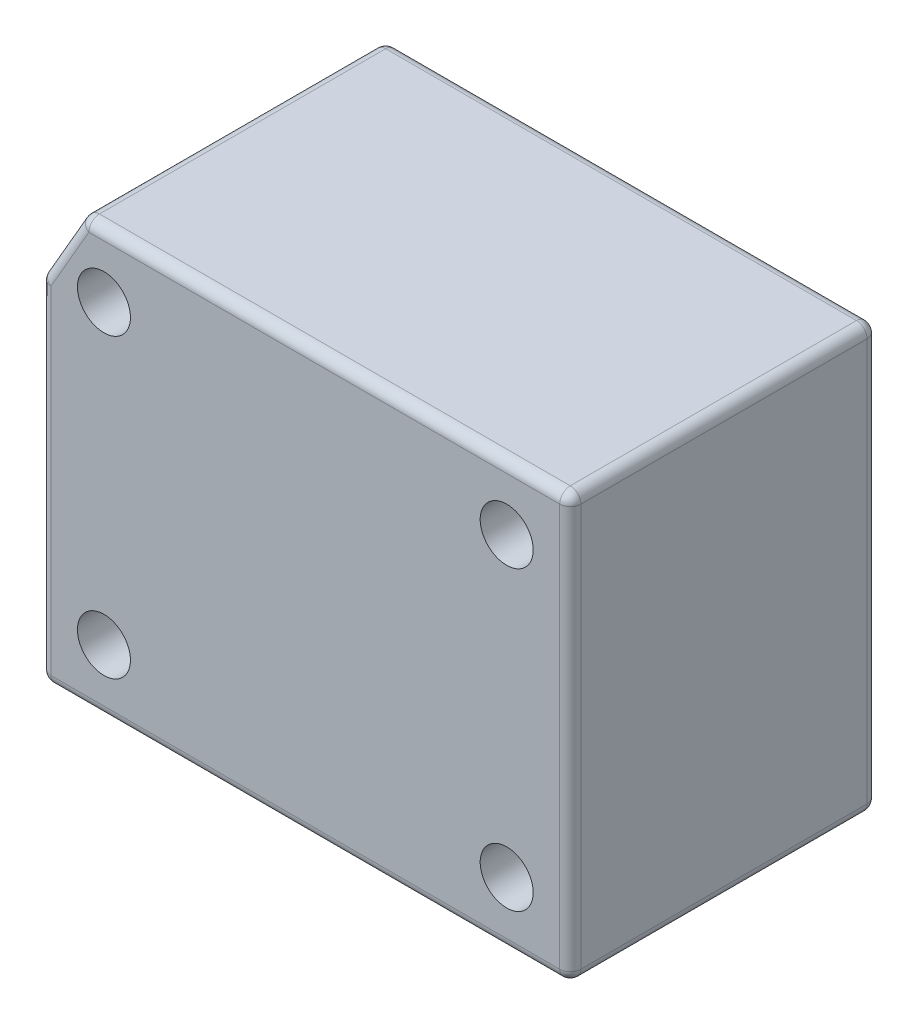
ISO-10303-21;
HEADER;
FILE_DESCRIPTION(('STEP AP214'),'2;1');
FILE_NAME('part.step','',(''),(''),'','','');
FILE_SCHEMA(('AUTOMOTIVE_DESIGN { 1 0 10303 214 1 1 1 1 }'));
ENDSEC;
DATA;
#1=APPLICATION_CONTEXT('core data for automotive mechanical design processes');
#2=APPLICATION_PROTOCOL_DEFINITION('international standard','automotive_design',2000,#1);
#3=PRODUCT_CONTEXT('',#1,'mechanical');
#4=PRODUCT('Part','Part','',(#3));
#5=PRODUCT_RELATED_PRODUCT_CATEGORY('part','',(#4));
#6=PRODUCT_DEFINITION_FORMATION('','',#4);
#7=PRODUCT_DEFINITION_CONTEXT('part definition',#1,'design');
#8=PRODUCT_DEFINITION('design','',#6,#7);
#9=PRODUCT_DEFINITION_SHAPE('','',#8);
#10=(LENGTH_UNIT() NAMED_UNIT(*) SI_UNIT(.MILLI.,.METRE.));
#11=(NAMED_UNIT(*) PLANE_ANGLE_UNIT() SI_UNIT($,.RADIAN.));
#12=(NAMED_UNIT(*) SI_UNIT($,.STERADIAN.) SOLID_ANGLE_UNIT());
#13=UNCERTAINTY_MEASURE_WITH_UNIT(LENGTH_MEASURE(1.E-05),#10,'distance_accuracy_value','');
#14=(GEOMETRIC_REPRESENTATION_CONTEXT(3) GLOBAL_UNCERTAINTY_ASSIGNED_CONTEXT((#13)) GLOBAL_UNIT_ASSIGNED_CONTEXT((#10,
#11,#12)) REPRESENTATION_CONTEXT('',''));
#15=CARTESIAN_POINT('',(0.,0.,0.));
#16=DIRECTION('',(0.,0.,1.));
#17=DIRECTION('',(1.,0.,0.));
#18=AXIS2_PLACEMENT_3D('',#15,#16,#17);
#19=CARTESIAN_POINT('',(22.,3.,0.));
#20=DIRECTION('',(0.,0.,1.));
#21=DIRECTION('',(1.,0.,0.));
#22=AXIS2_PLACEMENT_3D('',#19,#20,#21);
#23=CYLINDRICAL_SURFACE('',#22,0.750000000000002);
#24=CARTESIAN_POINT('',(22.,3.,0.));
#25=DIRECTION('',(0.,0.,1.));
#26=DIRECTION('',(1.,0.,0.));
#27=AXIS2_PLACEMENT_3D('',#24,#25,#26);
#28=CIRCLE('',#27,0.750000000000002);
#29=CARTESIAN_POINT('',(22.75,3.,0.));
#30=VERTEX_POINT('',#29);
#31=EDGE_CURVE('E270',#30,#30,#28,.T.);
#32=CARTESIAN_POINT('',(22.,3.,9.5));
#33=DIRECTION('',(0.,0.,1.));
#34=DIRECTION('',(1.,0.,0.));
#35=AXIS2_PLACEMENT_3D('',#32,#33,#34);
#36=CIRCLE('',#35,0.750000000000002);
#37=CARTESIAN_POINT('',(22.75,3.,9.5));
#38=VERTEX_POINT('',#37);
#39=EDGE_CURVE('E39',#38,#38,#36,.F.);
#40=CARTESIAN_POINT('',(22.75,3.,0.));
#41=CARTESIAN_POINT('',(22.75,3.,0.0989583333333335));
#42=CARTESIAN_POINT('',(22.75,3.,0.197916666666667));
#43=CARTESIAN_POINT('',(22.75,3.,0.395833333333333));
#44=CARTESIAN_POINT('',(22.75,3.,0.494791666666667));
#45=CARTESIAN_POINT('',(22.75,3.,0.692708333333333));
#46=CARTESIAN_POINT('',(22.75,3.,0.791666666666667));
#47=CARTESIAN_POINT('',(22.75,3.,0.989583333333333));
#48=CARTESIAN_POINT('',(22.75,3.,1.08854166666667));
#49=CARTESIAN_POINT('',(22.75,3.,1.28645833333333));
#50=CARTESIAN_POINT('',(22.75,3.,1.38541666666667));
#51=CARTESIAN_POINT('',(22.75,3.,1.58333333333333));
#52=CARTESIAN_POINT('',(22.75,3.,1.68229166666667));
#53=CARTESIAN_POINT('',(22.75,3.,1.88020833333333));
#54=CARTESIAN_POINT('',(22.75,3.,1.97916666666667));
#55=CARTESIAN_POINT('',(22.75,3.,2.17708333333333));
#56=CARTESIAN_POINT('',(22.75,3.,2.27604166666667));
#57=CARTESIAN_POINT('',(22.75,3.,2.47395833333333));
#58=CARTESIAN_POINT('',(22.75,3.,2.57291666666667));
#59=CARTESIAN_POINT('',(22.75,3.,2.77083333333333));
#60=CARTESIAN_POINT('',(22.75,3.,2.86979166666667));
#61=CARTESIAN_POINT('',(22.75,3.,3.06770833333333));
#62=CARTESIAN_POINT('',(22.75,3.,3.16666666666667));
#63=CARTESIAN_POINT('',(22.75,3.,3.36458333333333));
#64=CARTESIAN_POINT('',(22.75,3.,3.46354166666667));
#65=CARTESIAN_POINT('',(22.75,3.,3.66145833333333));
#66=CARTESIAN_POINT('',(22.75,3.,3.76041666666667));
#67=CARTESIAN_POINT('',(22.75,3.,3.95833333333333));
#68=CARTESIAN_POINT('',(22.75,3.,4.05729166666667));
#69=CARTESIAN_POINT('',(22.75,3.,4.25520833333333));
#70=CARTESIAN_POINT('',(22.75,3.,4.35416666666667));
#71=CARTESIAN_POINT('',(22.75,3.,4.55208333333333));
#72=CARTESIAN_POINT('',(22.75,3.,4.65104166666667));
#73=CARTESIAN_POINT('',(22.75,3.,4.84895833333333));
#74=CARTESIAN_POINT('',(22.75,3.,4.94791666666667));
#75=CARTESIAN_POINT('',(22.75,3.,5.14583333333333));
#76=CARTESIAN_POINT('',(22.75,3.,5.24479166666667));
#77=CARTESIAN_POINT('',(22.75,3.,5.44270833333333));
#78=CARTESIAN_POINT('',(22.75,3.,5.54166666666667));
#79=CARTESIAN_POINT('',(22.75,3.,5.73958333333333));
#80=CARTESIAN_POINT('',(22.75,3.,5.83854166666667));
#81=CARTESIAN_POINT('',(22.75,3.,6.03645833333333));
#82=CARTESIAN_POINT('',(22.75,3.,6.13541666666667));
#83=CARTESIAN_POINT('',(22.75,3.,6.33333333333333));
#84=CARTESIAN_POINT('',(22.75,3.,6.43229166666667));
#85=CARTESIAN_POINT('',(22.75,3.,6.63020833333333));
#86=CARTESIAN_POINT('',(22.75,3.,6.72916666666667));
#87=CARTESIAN_POINT('',(22.75,3.,6.92708333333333));
#88=CARTESIAN_POINT('',(22.75,3.,7.02604166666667));
#89=CARTESIAN_POINT('',(22.75,3.,7.22395833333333));
#90=CARTESIAN_POINT('',(22.75,3.,7.32291666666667));
#91=CARTESIAN_POINT('',(22.75,3.,7.52083333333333));
#92=CARTESIAN_POINT('',(22.75,3.,7.61979166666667));
#93=CARTESIAN_POINT('',(22.75,3.,7.81770833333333));
#94=CARTESIAN_POINT('',(22.75,3.,7.91666666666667));
#95=CARTESIAN_POINT('',(22.75,3.,8.11458333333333));
#96=CARTESIAN_POINT('',(22.75,3.,8.21354166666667));
#97=CARTESIAN_POINT('',(22.75,3.,8.41145833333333));
#98=CARTESIAN_POINT('',(22.75,3.,8.51041666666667));
#99=CARTESIAN_POINT('',(22.75,3.,8.70833333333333));
#100=CARTESIAN_POINT('',(22.75,3.,8.80729166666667));
#101=CARTESIAN_POINT('',(22.75,3.,9.00520833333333));
#102=CARTESIAN_POINT('',(22.75,3.,9.10416666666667));
#103=CARTESIAN_POINT('',(22.75,3.,9.30208333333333));
#104=CARTESIAN_POINT('',(22.75,3.,9.40104166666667));
#105=CARTESIAN_POINT('',(22.75,3.,9.5));
#106=B_SPLINE_CURVE_WITH_KNOTS('',3,(#40,#41,#42,#43,#44,#45,#46,#47,#48,#49,#50,#51,#52,#53,
#54,#55,#56,#57,#58,#59,#60,#61,#62,#63,#64,#65,#66,#67,#68,#69,#70,#71,#72,#73,#74,#75,#76,#77,
#78,#79,#80,#81,#82,#83,#84,#85,#86,#87,#88,#89,#90,#91,#92,#93,#94,#95,#96,#97,#98,#99,#100,
#101,#102,#103,#104,#105),.UNSPECIFIED.,.F.,.F.,(4,2,2,2,2,2,2,2,2,2,2,2,2,2,2,2,2,2,2,2,2,2,2,
2,2,2,2,2,2,2,2,2,4),(0.,0.296875,0.59375,0.890625,1.1875,1.484375,1.78125,2.078125,2.375,
2.671875,2.96875,3.265625,3.5625,3.859375,4.15625,4.453125,4.75,5.046875,5.34375,5.640625,
5.9375,6.234375,6.53125,6.828125,7.125,7.421875,7.71875,8.015625,8.3125,8.609375,8.90625,
9.203125,9.5),.UNSPECIFIED.);
#107=EDGE_CURVE('BSEAM35',#30,#38,#106,.T.);
#108=ORIENTED_EDGE('',*,*,#31,.F.);
#109=ORIENTED_EDGE('',*,*,#39,.F.);
#110=ORIENTED_EDGE('',*,*,#107,.T.);
#111=ORIENTED_EDGE('',*,*,#107,.F.);
#112=EDGE_LOOP('',(#108,#110,#109,#111));
#113=FACE_BOUND('',#112,.T.);
#114=ADVANCED_FACE('F35',(#113),#23,.F.);
#115=CARTESIAN_POINT('',(3.,3.,0.));
#116=DIRECTION('',(0.,0.,1.));
#117=DIRECTION('',(1.,0.,0.));
#118=AXIS2_PLACEMENT_3D('',#115,#116,#117);
#119=CYLINDRICAL_SURFACE('',#118,0.75);
#120=CARTESIAN_POINT('',(3.,3.,0.));
#121=DIRECTION('',(0.,0.,1.));
#122=DIRECTION('',(1.,0.,0.));
#123=AXIS2_PLACEMENT_3D('',#120,#121,#122);
#124=CIRCLE('',#123,0.75);
#125=CARTESIAN_POINT('',(3.75,3.,0.));
#126=VERTEX_POINT('',#125);
#127=EDGE_CURVE('E237',#126,#126,#124,.T.);
#128=CARTESIAN_POINT('',(3.,3.,9.5));
#129=DIRECTION('',(0.,0.,1.));
#130=DIRECTION('',(1.,0.,0.));
#131=AXIS2_PLACEMENT_3D('',#128,#129,#130);
#132=CIRCLE('',#131,0.75);
#133=CARTESIAN_POINT('',(3.75,3.,9.5));
#134=VERTEX_POINT('',#133);
#135=EDGE_CURVE('E243',#134,#134,#132,.F.);
#136=CARTESIAN_POINT('',(3.75,3.,0.));
#137=CARTESIAN_POINT('',(3.75,3.,0.0989583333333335));
#138=CARTESIAN_POINT('',(3.75,3.,0.197916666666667));
#139=CARTESIAN_POINT('',(3.75,3.,0.395833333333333));
#140=CARTESIAN_POINT('',(3.75,3.,0.494791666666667));
#141=CARTESIAN_POINT('',(3.75,3.,0.692708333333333));
#142=CARTESIAN_POINT('',(3.75,3.,0.791666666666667));
#143=CARTESIAN_POINT('',(3.75,3.,0.989583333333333));
#144=CARTESIAN_POINT('',(3.75,3.,1.08854166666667));
#145=CARTESIAN_POINT('',(3.75,3.,1.28645833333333));
#146=CARTESIAN_POINT('',(3.75,3.,1.38541666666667));
#147=CARTESIAN_POINT('',(3.75,3.,1.58333333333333));
#148=CARTESIAN_POINT('',(3.75,3.,1.68229166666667));
#149=CARTESIAN_POINT('',(3.75,3.,1.88020833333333));
#150=CARTESIAN_POINT('',(3.75,3.,1.97916666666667));
#151=CARTESIAN_POINT('',(3.75,3.,2.17708333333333));
#152=CARTESIAN_POINT('',(3.75,3.,2.27604166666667));
#153=CARTESIAN_POINT('',(3.75,3.,2.47395833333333));
#154=CARTESIAN_POINT('',(3.75,3.,2.57291666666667));
#155=CARTESIAN_POINT('',(3.75,3.,2.77083333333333));
#156=CARTESIAN_POINT('',(3.75,3.,2.86979166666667));
#157=CARTESIAN_POINT('',(3.75,3.,3.06770833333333));
#158=CARTESIAN_POINT('',(3.75,3.,3.16666666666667));
#159=CARTESIAN_POINT('',(3.75,3.,3.36458333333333));
#160=CARTESIAN_POINT('',(3.75,3.,3.46354166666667));
#161=CARTESIAN_POINT('',(3.75,3.,3.66145833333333));
#162=CARTESIAN_POINT('',(3.75,3.,3.76041666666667));
#163=CARTESIAN_POINT('',(3.75,3.,3.95833333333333));
#164=CARTESIAN_POINT('',(3.75,3.,4.05729166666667));
#165=CARTESIAN_POINT('',(3.75,3.,4.25520833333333));
#166=CARTESIAN_POINT('',(3.75,3.,4.35416666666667));
#167=CARTESIAN_POINT('',(3.75,3.,4.55208333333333));
#168=CARTESIAN_POINT('',(3.75,3.,4.65104166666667));
#169=CARTESIAN_POINT('',(3.75,3.,4.84895833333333));
#170=CARTESIAN_POINT('',(3.75,3.,4.94791666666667));
#171=CARTESIAN_POINT('',(3.75,3.,5.14583333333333));
#172=CARTESIAN_POINT('',(3.75,3.,5.24479166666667));
#173=CARTESIAN_POINT('',(3.75,3.,5.44270833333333));
#174=CARTESIAN_POINT('',(3.75,3.,5.54166666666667));
#175=CARTESIAN_POINT('',(3.75,3.,5.73958333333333));
#176=CARTESIAN_POINT('',(3.75,3.,5.83854166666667));
#177=CARTESIAN_POINT('',(3.75,3.,6.03645833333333));
#178=CARTESIAN_POINT('',(3.75,3.,6.13541666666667));
#179=CARTESIAN_POINT('',(3.75,3.,6.33333333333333));
#180=CARTESIAN_POINT('',(3.75,3.,6.43229166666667));
#181=CARTESIAN_POINT('',(3.75,3.,6.63020833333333));
#182=CARTESIAN_POINT('',(3.75,3.,6.72916666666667));
#183=CARTESIAN_POINT('',(3.75,3.,6.92708333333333));
#184=CARTESIAN_POINT('',(3.75,3.,7.02604166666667));
#185=CARTESIAN_POINT('',(3.75,3.,7.22395833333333));
#186=CARTESIAN_POINT('',(3.75,3.,7.32291666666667));
#187=CARTESIAN_POINT('',(3.75,3.,7.52083333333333));
#188=CARTESIAN_POINT('',(3.75,3.,7.61979166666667));
#189=CARTESIAN_POINT('',(3.75,3.,7.81770833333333));
#190=CARTESIAN_POINT('',(3.75,3.,7.91666666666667));
#191=CARTESIAN_POINT('',(3.75,3.,8.11458333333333));
#192=CARTESIAN_POINT('',(3.75,3.,8.21354166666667));
#193=CARTESIAN_POINT('',(3.75,3.,8.41145833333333));
#194=CARTESIAN_POINT('',(3.75,3.,8.51041666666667));
#195=CARTESIAN_POINT('',(3.75,3.,8.70833333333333));
#196=CARTESIAN_POINT('',(3.75,3.,8.80729166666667));
#197=CARTESIAN_POINT('',(3.75,3.,9.00520833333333));
#198=CARTESIAN_POINT('',(3.75,3.,9.10416666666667));
#199=CARTESIAN_POINT('',(3.75,3.,9.30208333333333));
#200=CARTESIAN_POINT('',(3.75,3.,9.40104166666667));
#201=CARTESIAN_POINT('',(3.75,3.,9.5));
#202=B_SPLINE_CURVE_WITH_KNOTS('',3,(#136,#137,#138,#139,#140,#141,#142,#143,#144,#145,#146,
#147,#148,#149,#150,#151,#152,#153,#154,#155,#156,#157,#158,#159,#160,#161,#162,#163,#164,#165,
#166,#167,#168,#169,#170,#171,#172,#173,#174,#175,#176,#177,#178,#179,#180,#181,#182,#183,#184,
#185,#186,#187,#188,#189,#190,#191,#192,#193,#194,#195,#196,#197,#198,#199,#200,#201),
.UNSPECIFIED.,.F.,.F.,(4,2,2,2,2,2,2,2,2,2,2,2,2,2,2,2,2,2,2,2,2,2,2,2,2,2,2,2,2,2,2,2,4),(0.,
0.296875,0.59375,0.890625,1.1875,1.484375,1.78125,2.078125,2.375,2.671875,2.96875,3.265625,
3.5625,3.859375,4.15625,4.453125,4.75,5.046875,5.34375,5.640625,5.9375,6.234375,6.53125,
6.828125,7.125,7.421875,7.71875,8.015625,8.3125,8.609375,8.90625,9.203125,9.5),.UNSPECIFIED.);
#203=EDGE_CURVE('BSEAM445',#126,#134,#202,.T.);
#204=ORIENTED_EDGE('',*,*,#127,.F.);
#205=ORIENTED_EDGE('',*,*,#135,.F.);
#206=ORIENTED_EDGE('',*,*,#203,.T.);
#207=ORIENTED_EDGE('',*,*,#203,.F.);
#208=EDGE_LOOP('',(#204,#206,#205,#207));
#209=FACE_BOUND('',#208,.T.);
#210=ADVANCED_FACE('F445',(#209),#119,.F.);
#211=CARTESIAN_POINT('',(22.,17.,0.));
#212=DIRECTION('',(0.,0.,1.));
#213=DIRECTION('',(1.,0.,0.));
#214=AXIS2_PLACEMENT_3D('',#211,#212,#213);
#215=CYLINDRICAL_SURFACE('',#214,0.750000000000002);
#216=CARTESIAN_POINT('',(22.,17.,0.));
#217=DIRECTION('',(0.,0.,1.));
#218=DIRECTION('',(1.,0.,0.));
#219=AXIS2_PLACEMENT_3D('',#216,#217,#218);
#220=CIRCLE('',#219,0.750000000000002);
#221=CARTESIAN_POINT('',(22.75,17.,0.));
#222=VERTEX_POINT('',#221);
#223=EDGE_CURVE('E273',#222,#222,#220,.T.);
#224=CARTESIAN_POINT('',(22.,17.,9.5));
#225=DIRECTION('',(0.,0.,1.));
#226=DIRECTION('',(1.,0.,0.));
#227=AXIS2_PLACEMENT_3D('',#224,#225,#226);
#228=CIRCLE('',#227,0.750000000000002);
#229=CARTESIAN_POINT('',(22.75,17.,9.5));
#230=VERTEX_POINT('',#229);
#231=EDGE_CURVE('E239',#230,#230,#228,.F.);
#232=CARTESIAN_POINT('',(22.75,17.,0.));
#233=CARTESIAN_POINT('',(22.75,17.,0.0989583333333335));
#234=CARTESIAN_POINT('',(22.75,17.,0.197916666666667));
#235=CARTESIAN_POINT('',(22.75,17.,0.395833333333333));
#236=CARTESIAN_POINT('',(22.75,17.,0.494791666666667));
#237=CARTESIAN_POINT('',(22.75,17.,0.692708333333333));
#238=CARTESIAN_POINT('',(22.75,17.,0.791666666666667));
#239=CARTESIAN_POINT('',(22.75,17.,0.989583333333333));
#240=CARTESIAN_POINT('',(22.75,17.,1.08854166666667));
#241=CARTESIAN_POINT('',(22.75,17.,1.28645833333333));
#242=CARTESIAN_POINT('',(22.75,17.,1.38541666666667));
#243=CARTESIAN_POINT('',(22.75,17.,1.58333333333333));
#244=CARTESIAN_POINT('',(22.75,17.,1.68229166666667));
#245=CARTESIAN_POINT('',(22.75,17.,1.88020833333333));
#246=CARTESIAN_POINT('',(22.75,17.,1.97916666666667));
#247=CARTESIAN_POINT('',(22.75,17.,2.17708333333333));
#248=CARTESIAN_POINT('',(22.75,17.,2.27604166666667));
#249=CARTESIAN_POINT('',(22.75,17.,2.47395833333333));
#250=CARTESIAN_POINT('',(22.75,17.,2.57291666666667));
#251=CARTESIAN_POINT('',(22.75,17.,2.77083333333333));
#252=CARTESIAN_POINT('',(22.75,17.,2.86979166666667));
#253=CARTESIAN_POINT('',(22.75,17.,3.06770833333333));
#254=CARTESIAN_POINT('',(22.75,17.,3.16666666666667));
#255=CARTESIAN_POINT('',(22.75,17.,3.36458333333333));
#256=CARTESIAN_POINT('',(22.75,17.,3.46354166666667));
#257=CARTESIAN_POINT('',(22.75,17.,3.66145833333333));
#258=CARTESIAN_POINT('',(22.75,17.,3.76041666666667));
#259=CARTESIAN_POINT('',(22.75,17.,3.95833333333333));
#260=CARTESIAN_POINT('',(22.75,17.,4.05729166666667));
#261=CARTESIAN_POINT('',(22.75,17.,4.25520833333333));
#262=CARTESIAN_POINT('',(22.75,17.,4.35416666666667));
#263=CARTESIAN_POINT('',(22.75,17.,4.55208333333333));
#264=CARTESIAN_POINT('',(22.75,17.,4.65104166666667));
#265=CARTESIAN_POINT('',(22.75,17.,4.84895833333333));
#266=CARTESIAN_POINT('',(22.75,17.,4.94791666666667));
#267=CARTESIAN_POINT('',(22.75,17.,5.14583333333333));
#268=CARTESIAN_POINT('',(22.75,17.,5.24479166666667));
#269=CARTESIAN_POINT('',(22.75,17.,5.44270833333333));
#270=CARTESIAN_POINT('',(22.75,17.,5.54166666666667));
#271=CARTESIAN_POINT('',(22.75,17.,5.73958333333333));
#272=CARTESIAN_POINT('',(22.75,17.,5.83854166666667));
#273=CARTESIAN_POINT('',(22.75,17.,6.03645833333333));
#274=CARTESIAN_POINT('',(22.75,17.,6.13541666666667));
#275=CARTESIAN_POINT('',(22.75,17.,6.33333333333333));
#276=CARTESIAN_POINT('',(22.75,17.,6.43229166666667));
#277=CARTESIAN_POINT('',(22.75,17.,6.63020833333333));
#278=CARTESIAN_POINT('',(22.75,17.,6.72916666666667));
#279=CARTESIAN_POINT('',(22.75,17.,6.92708333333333));
#280=CARTESIAN_POINT('',(22.75,17.,7.02604166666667));
#281=CARTESIAN_POINT('',(22.75,17.,7.22395833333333));
#282=CARTESIAN_POINT('',(22.75,17.,7.32291666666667));
#283=CARTESIAN_POINT('',(22.75,17.,7.52083333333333));
#284=CARTESIAN_POINT('',(22.75,17.,7.61979166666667));
#285=CARTESIAN_POINT('',(22.75,17.,7.81770833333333));
#286=CARTESIAN_POINT('',(22.75,17.,7.91666666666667));
#287=CARTESIAN_POINT('',(22.75,17.,8.11458333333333));
#288=CARTESIAN_POINT('',(22.75,17.,8.21354166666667));
#289=CARTESIAN_POINT('',(22.75,17.,8.41145833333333));
#290=CARTESIAN_POINT('',(22.75,17.,8.51041666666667));
#291=CARTESIAN_POINT('',(22.75,17.,8.70833333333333));
#292=CARTESIAN_POINT('',(22.75,17.,8.80729166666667));
#293=CARTESIAN_POINT('',(22.75,17.,9.00520833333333));
#294=CARTESIAN_POINT('',(22.75,17.,9.10416666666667));
#295=CARTESIAN_POINT('',(22.75,17.,9.30208333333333));
#296=CARTESIAN_POINT('',(22.75,17.,9.40104166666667));
#297=CARTESIAN_POINT('',(22.75,17.,9.5));
#298=B_SPLINE_CURVE_WITH_KNOTS('',3,(#232,#233,#234,#235,#236,#237,#238,#239,#240,#241,#242,
#243,#244,#245,#246,#247,#248,#249,#250,#251,#252,#253,#254,#255,#256,#257,#258,#259,#260,#261,
#262,#263,#264,#265,#266,#267,#268,#269,#270,#271,#272,#273,#274,#275,#276,#277,#278,#279,#280,
#281,#282,#283,#284,#285,#286,#287,#288,#289,#290,#291,#292,#293,#294,#295,#296,#297),
.UNSPECIFIED.,.F.,.F.,(4,2,2,2,2,2,2,2,2,2,2,2,2,2,2,2,2,2,2,2,2,2,2,2,2,2,2,2,2,2,2,2,4),(0.,
0.296875,0.59375,0.890625,1.1875,1.484375,1.78125,2.078125,2.375,2.671875,2.96875,3.265625,
3.5625,3.859375,4.15625,4.453125,4.75,5.046875,5.34375,5.640625,5.9375,6.234375,6.53125,
6.828125,7.125,7.421875,7.71875,8.015625,8.3125,8.609375,8.90625,9.203125,9.5),.UNSPECIFIED.);
#299=EDGE_CURVE('BSEAM451',#222,#230,#298,.T.);
#300=ORIENTED_EDGE('',*,*,#223,.F.);
#301=ORIENTED_EDGE('',*,*,#231,.F.);
#302=ORIENTED_EDGE('',*,*,#299,.T.);
#303=ORIENTED_EDGE('',*,*,#299,.F.);
#304=EDGE_LOOP('',(#300,#302,#301,#303));
#305=FACE_BOUND('',#304,.T.);
#306=ADVANCED_FACE('F451',(#305),#215,.F.);
#307=CARTESIAN_POINT('',(3.,17.,0.));
#308=DIRECTION('',(0.,0.,1.));
#309=DIRECTION('',(1.,0.,0.));
#310=AXIS2_PLACEMENT_3D('',#307,#308,#309);
#311=CYLINDRICAL_SURFACE('',#310,0.75);
#312=CARTESIAN_POINT('',(3.,17.,0.));
#313=DIRECTION('',(0.,0.,1.));
#314=DIRECTION('',(1.,0.,0.));
#315=AXIS2_PLACEMENT_3D('',#312,#313,#314);
#316=CIRCLE('',#315,0.75);
#317=CARTESIAN_POINT('',(3.75,17.,0.));
#318=VERTEX_POINT('',#317);
#319=EDGE_CURVE('E231',#318,#318,#316,.T.);
#320=CARTESIAN_POINT('',(3.,17.,9.5));
#321=DIRECTION('',(0.,0.,1.));
#322=DIRECTION('',(1.,0.,0.));
#323=AXIS2_PLACEMENT_3D('',#320,#321,#322);
#324=CIRCLE('',#323,0.75);
#325=CARTESIAN_POINT('',(3.75,17.,9.5));
#326=VERTEX_POINT('',#325);
#327=EDGE_CURVE('E234',#326,#326,#324,.F.);
#328=CARTESIAN_POINT('',(3.75,17.,0.));
#329=CARTESIAN_POINT('',(3.75,17.,0.0989583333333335));
#330=CARTESIAN_POINT('',(3.75,17.,0.197916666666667));
#331=CARTESIAN_POINT('',(3.75,17.,0.395833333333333));
#332=CARTESIAN_POINT('',(3.75,17.,0.494791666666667));
#333=CARTESIAN_POINT('',(3.75,17.,0.692708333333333));
#334=CARTESIAN_POINT('',(3.75,17.,0.791666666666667));
#335=CARTESIAN_POINT('',(3.75,17.,0.989583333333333));
#336=CARTESIAN_POINT('',(3.75,17.,1.08854166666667));
#337=CARTESIAN_POINT('',(3.75,17.,1.28645833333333));
#338=CARTESIAN_POINT('',(3.75,17.,1.38541666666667));
#339=CARTESIAN_POINT('',(3.75,17.,1.58333333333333));
#340=CARTESIAN_POINT('',(3.75,17.,1.68229166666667));
#341=CARTESIAN_POINT('',(3.75,17.,1.88020833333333));
#342=CARTESIAN_POINT('',(3.75,17.,1.97916666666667));
#343=CARTESIAN_POINT('',(3.75,17.,2.17708333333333));
#344=CARTESIAN_POINT('',(3.75,17.,2.27604166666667));
#345=CARTESIAN_POINT('',(3.75,17.,2.47395833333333));
#346=CARTESIAN_POINT('',(3.75,17.,2.57291666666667));
#347=CARTESIAN_POINT('',(3.75,17.,2.77083333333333));
#348=CARTESIAN_POINT('',(3.75,17.,2.86979166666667));
#349=CARTESIAN_POINT('',(3.75,17.,3.06770833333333));
#350=CARTESIAN_POINT('',(3.75,17.,3.16666666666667));
#351=CARTESIAN_POINT('',(3.75,17.,3.36458333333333));
#352=CARTESIAN_POINT('',(3.75,17.,3.46354166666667));
#353=CARTESIAN_POINT('',(3.75,17.,3.66145833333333));
#354=CARTESIAN_POINT('',(3.75,17.,3.76041666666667));
#355=CARTESIAN_POINT('',(3.75,17.,3.95833333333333));
#356=CARTESIAN_POINT('',(3.75,17.,4.05729166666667));
#357=CARTESIAN_POINT('',(3.75,17.,4.25520833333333));
#358=CARTESIAN_POINT('',(3.75,17.,4.35416666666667));
#359=CARTESIAN_POINT('',(3.75,17.,4.55208333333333));
#360=CARTESIAN_POINT('',(3.75,17.,4.65104166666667));
#361=CARTESIAN_POINT('',(3.75,17.,4.84895833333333));
#362=CARTESIAN_POINT('',(3.75,17.,4.94791666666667));
#363=CARTESIAN_POINT('',(3.75,17.,5.14583333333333));
#364=CARTESIAN_POINT('',(3.75,17.,5.24479166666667));
#365=CARTESIAN_POINT('',(3.75,17.,5.44270833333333));
#366=CARTESIAN_POINT('',(3.75,17.,5.54166666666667));
#367=CARTESIAN_POINT('',(3.75,17.,5.73958333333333));
#368=CARTESIAN_POINT('',(3.75,17.,5.83854166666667));
#369=CARTESIAN_POINT('',(3.75,17.,6.03645833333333));
#370=CARTESIAN_POINT('',(3.75,17.,6.13541666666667));
#371=CARTESIAN_POINT('',(3.75,17.,6.33333333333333));
#372=CARTESIAN_POINT('',(3.75,17.,6.43229166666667));
#373=CARTESIAN_POINT('',(3.75,17.,6.63020833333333));
#374=CARTESIAN_POINT('',(3.75,17.,6.72916666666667));
#375=CARTESIAN_POINT('',(3.75,17.,6.92708333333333));
#376=CARTESIAN_POINT('',(3.75,17.,7.02604166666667));
#377=CARTESIAN_POINT('',(3.75,17.,7.22395833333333));
#378=CARTESIAN_POINT('',(3.75,17.,7.32291666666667));
#379=CARTESIAN_POINT('',(3.75,17.,7.52083333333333));
#380=CARTESIAN_POINT('',(3.75,17.,7.61979166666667));
#381=CARTESIAN_POINT('',(3.75,17.,7.81770833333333));
#382=CARTESIAN_POINT('',(3.75,17.,7.91666666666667));
#383=CARTESIAN_POINT('',(3.75,17.,8.11458333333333));
#384=CARTESIAN_POINT('',(3.75,17.,8.21354166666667));
#385=CARTESIAN_POINT('',(3.75,17.,8.41145833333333));
#386=CARTESIAN_POINT('',(3.75,17.,8.51041666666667));
#387=CARTESIAN_POINT('',(3.75,17.,8.70833333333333));
#388=CARTESIAN_POINT('',(3.75,17.,8.80729166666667));
#389=CARTESIAN_POINT('',(3.75,17.,9.00520833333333));
#390=CARTESIAN_POINT('',(3.75,17.,9.10416666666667));
#391=CARTESIAN_POINT('',(3.75,17.,9.30208333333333));
#392=CARTESIAN_POINT('',(3.75,17.,9.40104166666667));
#393=CARTESIAN_POINT('',(3.75,17.,9.5));
#394=B_SPLINE_CURVE_WITH_KNOTS('',3,(#328,#329,#330,#331,#332,#333,#334,#335,#336,#337,#338,
#339,#340,#341,#342,#343,#344,#345,#346,#347,#348,#349,#350,#351,#352,#353,#354,#355,#356,#357,
#358,#359,#360,#361,#362,#363,#364,#365,#366,#367,#368,#369,#370,#371,#372,#373,#374,#375,#376,
#377,#378,#379,#380,#381,#382,#383,#384,#385,#386,#387,#388,#389,#390,#391,#392,#393),
.UNSPECIFIED.,.F.,.F.,(4,2,2,2,2,2,2,2,2,2,2,2,2,2,2,2,2,2,2,2,2,2,2,2,2,2,2,2,2,2,2,2,4),(0.,
0.296875,0.59375,0.890625,1.1875,1.484375,1.78125,2.078125,2.375,2.671875,2.96875,3.265625,
3.5625,3.859375,4.15625,4.453125,4.75,5.046875,5.34375,5.640625,5.9375,6.234375,6.53125,
6.828125,7.125,7.421875,7.71875,8.015625,8.3125,8.609375,8.90625,9.203125,9.5),.UNSPECIFIED.);
#395=EDGE_CURVE('BSEAM460',#318,#326,#394,.T.);
#396=ORIENTED_EDGE('',*,*,#319,.F.);
#397=ORIENTED_EDGE('',*,*,#327,.F.);
#398=ORIENTED_EDGE('',*,*,#395,.T.);
#399=ORIENTED_EDGE('',*,*,#395,.F.);
#400=EDGE_LOOP('',(#396,#398,#397,#399));
#401=FACE_BOUND('',#400,.T.);
#402=ADVANCED_FACE('F460',(#401),#311,.F.);
#403=CARTESIAN_POINT('',(0.,0.,14.5));
#404=DIRECTION('',(1.,0.,0.));
#405=DIRECTION('',(0.,0.,-1.));
#406=AXIS2_PLACEMENT_3D('',#403,#404,#405);
#407=PLANE('',#406);
#408=DIRECTION('',(0.,-1.,0.));
#409=VECTOR('',#408,1.);
#410=CARTESIAN_POINT('',(0.,0.,0.5));
#411=LINE('',#410,#409);
#412=CARTESIAN_POINT('',(0.,16.4019237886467,0.5));
#413=VERTEX_POINT('',#412);
#414=CARTESIAN_POINT('',(0.,0.5,0.5));
#415=VERTEX_POINT('',#414);
#416=EDGE_CURVE('E329',#413,#415,#411,.T.);
#417=ORIENTED_EDGE('',*,*,#416,.T.);
#418=DIRECTION('',(0.,0.,-1.));
#419=VECTOR('',#418,1.);
#420=CARTESIAN_POINT('',(0.,0.5,14.5));
#421=LINE('',#420,#419);
#422=CARTESIAN_POINT('',(0.,0.5,14.));
#423=VERTEX_POINT('',#422);
#424=EDGE_CURVE('E335',#415,#423,#421,.F.);
#425=ORIENTED_EDGE('',*,*,#424,.T.);
#426=DIRECTION('',(0.,-1.,0.));
#427=VECTOR('',#426,1.);
#428=CARTESIAN_POINT('',(0.,0.,14.));
#429=LINE('',#428,#427);
#430=CARTESIAN_POINT('',(0.,16.4019237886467,14.));
#431=VERTEX_POINT('',#430);
#432=EDGE_CURVE('E332',#423,#431,#429,.F.);
#433=ORIENTED_EDGE('',*,*,#432,.T.);
#434=DIRECTION('',(0.,0.,1.));
#435=VECTOR('',#434,1.);
#436=CARTESIAN_POINT('',(0.,16.4019237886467,0.));
#437=LINE('',#436,#435);
#438=EDGE_CURVE('E327',#431,#413,#437,.F.);
#439=ORIENTED_EDGE('',*,*,#438,.T.);
#440=EDGE_LOOP('',(#417,#425,#433,#439));
#441=FACE_BOUND('',#440,.T.);
#442=ADVANCED_FACE('F421',(#441),#407,.F.);
#443=CARTESIAN_POINT('',(0.,0.,14.5));
#444=DIRECTION('',(0.,1.,0.));
#445=DIRECTION('',(0.,0.,1.));
#446=AXIS2_PLACEMENT_3D('',#443,#444,#445);
#447=PLANE('',#446);
#448=DIRECTION('',(0.,0.,-1.));
#449=VECTOR('',#448,1.);
#450=CARTESIAN_POINT('',(0.5,0.,14.5));
#451=LINE('',#450,#449);
#452=CARTESIAN_POINT('',(0.5,0.,14.));
#453=VERTEX_POINT('',#452);
#454=CARTESIAN_POINT('',(0.5,0.,0.5));
#455=VERTEX_POINT('',#454);
#456=EDGE_CURVE('E324',#453,#455,#451,.T.);
#457=ORIENTED_EDGE('',*,*,#456,.T.);
#458=DIRECTION('',(1.,0.,0.));
#459=VECTOR('',#458,1.);
#460=CARTESIAN_POINT('',(24.5,0.,0.5));
#461=LINE('',#460,#459);
#462=CARTESIAN_POINT('',(24.5,0.,0.5));
#463=VERTEX_POINT('',#462);
#464=EDGE_CURVE('E219',#455,#463,#461,.T.);
#465=ORIENTED_EDGE('',*,*,#464,.T.);
#466=DIRECTION('',(0.,0.,-1.));
#467=VECTOR('',#466,1.);
#468=CARTESIAN_POINT('',(24.5,0.,14.5));
#469=LINE('',#468,#467);
#470=CARTESIAN_POINT('',(24.5,0.,14.));
#471=VERTEX_POINT('',#470);
#472=EDGE_CURVE('E309',#463,#471,#469,.F.);
#473=ORIENTED_EDGE('',*,*,#472,.T.);
#474=DIRECTION('',(1.,0.,0.));
#475=VECTOR('',#474,1.);
#476=CARTESIAN_POINT('',(0.,0.,14.));
#477=LINE('',#476,#475);
#478=EDGE_CURVE('E217',#471,#453,#477,.F.);
#479=ORIENTED_EDGE('',*,*,#478,.T.);
#480=EDGE_LOOP('',(#457,#465,#473,#479));
#481=FACE_BOUND('',#480,.T.);
#482=ADVANCED_FACE('F407',(#481),#447,.F.);
#483=CARTESIAN_POINT('',(25.,0.,14.5));
#484=DIRECTION('',(-1.,0.,0.));
#485=DIRECTION('',(0.,0.,1.));
#486=AXIS2_PLACEMENT_3D('',#483,#484,#485);
#487=PLANE('',#486);
#488=DIRECTION('',(0.,0.,-1.));
#489=VECTOR('',#488,1.);
#490=CARTESIAN_POINT('',(25.,0.5,14.5));
#491=LINE('',#490,#489);
#492=CARTESIAN_POINT('',(25.,0.5,14.));
#493=VERTEX_POINT('',#492);
#494=CARTESIAN_POINT('',(25.,0.5,0.5));
#495=VERTEX_POINT('',#494);
#496=EDGE_CURVE('E301',#493,#495,#491,.T.);
#497=ORIENTED_EDGE('',*,*,#496,.T.);
#498=DIRECTION('',(0.,1.,0.));
#499=VECTOR('',#498,1.);
#500=CARTESIAN_POINT('',(25.,19.5,0.5));
#501=LINE('',#500,#499);
#502=CARTESIAN_POINT('',(25.,19.5,0.5));
#503=VERTEX_POINT('',#502);
#504=EDGE_CURVE('E304',#495,#503,#501,.T.);
#505=ORIENTED_EDGE('',*,*,#504,.T.);
#506=DIRECTION('',(0.,0.,-1.));
#507=VECTOR('',#506,1.);
#508=CARTESIAN_POINT('',(25.,19.5,14.5));
#509=LINE('',#508,#507);
#510=CARTESIAN_POINT('',(25.,19.5,14.));
#511=VERTEX_POINT('',#510);
#512=EDGE_CURVE('E281',#503,#511,#509,.F.);
#513=ORIENTED_EDGE('',*,*,#512,.T.);
#514=DIRECTION('',(0.,1.,0.));
#515=VECTOR('',#514,1.);
#516=CARTESIAN_POINT('',(25.,0.,14.));
#517=LINE('',#516,#515);
#518=EDGE_CURVE('E298',#511,#493,#517,.F.);
#519=ORIENTED_EDGE('',*,*,#518,.T.);
#520=EDGE_LOOP('',(#497,#505,#513,#519));
#521=FACE_BOUND('',#520,.T.);
#522=ADVANCED_FACE('F389',(#521),#487,.F.);
#523=CARTESIAN_POINT('',(0.,20.,14.5));
#524=DIRECTION('',(0.,-1.,0.));
#525=DIRECTION('',(0.,0.,-1.));
#526=AXIS2_PLACEMENT_3D('',#523,#524,#525);
#527=PLANE('',#526);
#528=DIRECTION('',(-1.,0.,0.));
#529=VECTOR('',#528,1.);
#530=CARTESIAN_POINT('',(0.,20.,14.));
#531=LINE('',#530,#529);
#532=CARTESIAN_POINT('',(2.28867513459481,20.,14.));
#533=VERTEX_POINT('',#532);
#534=CARTESIAN_POINT('',(24.5,20.,14.));
#535=VERTEX_POINT('',#534);
#536=EDGE_CURVE('E162',#533,#535,#531,.F.);
#537=ORIENTED_EDGE('',*,*,#536,.T.);
#538=DIRECTION('',(0.,0.,-1.));
#539=VECTOR('',#538,1.);
#540=CARTESIAN_POINT('',(24.5,20.,14.5));
#541=LINE('',#540,#539);
#542=CARTESIAN_POINT('',(24.5,20.,0.5));
#543=VERTEX_POINT('',#542);
#544=EDGE_CURVE('E279',#535,#543,#541,.T.);
#545=ORIENTED_EDGE('',*,*,#544,.T.);
#546=DIRECTION('',(-1.,0.,0.));
#547=VECTOR('',#546,1.);
#548=CARTESIAN_POINT('',(2.,20.,0.5));
#549=LINE('',#548,#547);
#550=CARTESIAN_POINT('',(2.28867513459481,20.,0.5));
#551=VERTEX_POINT('',#550);
#552=EDGE_CURVE('E165',#543,#551,#549,.T.);
#553=ORIENTED_EDGE('',*,*,#552,.T.);
#554=DIRECTION('',(0.,0.,-1.));
#555=VECTOR('',#554,1.);
#556=CARTESIAN_POINT('',(2.28867513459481,20.,14.5));
#557=LINE('',#556,#555);
#558=EDGE_CURVE('E148',#551,#533,#557,.F.);
#559=ORIENTED_EDGE('',*,*,#558,.T.);
#560=EDGE_LOOP('',(#537,#545,#553,#559));
#561=FACE_BOUND('',#560,.T.);
#562=ADVANCED_FACE('F160',(#561),#527,.F.);
#563=CARTESIAN_POINT('',(0.,0.,14.5));
#564=DIRECTION('',(0.,0.,-1.));
#565=DIRECTION('',(-1.,0.,0.));
#566=AXIS2_PLACEMENT_3D('',#563,#564,#565);
#567=PLANE('',#566);
#568=CARTESIAN_POINT('',(22.,3.,14.5));
#569=DIRECTION('',(0.,0.,1.));
#570=DIRECTION('',(1.,0.,0.));
#571=AXIS2_PLACEMENT_3D('',#568,#569,#570);
#572=CIRCLE('',#571,1.25);
#573=CARTESIAN_POINT('',(23.25,3.,14.5));
#574=VERTEX_POINT('',#573);
#575=EDGE_CURVE('E259',#574,#574,#572,.T.);
#576=ORIENTED_EDGE('',*,*,#575,.F.);
#577=EDGE_LOOP('',(#576));
#578=FACE_BOUND('',#577,.T.);
#579=CARTESIAN_POINT('',(3.,3.,14.5));
#580=DIRECTION('',(0.,0.,1.));
#581=DIRECTION('',(1.,0.,0.));
#582=AXIS2_PLACEMENT_3D('',#579,#580,#581);
#583=CIRCLE('',#582,1.25);
#584=CARTESIAN_POINT('',(4.25,3.,14.5));
#585=VERTEX_POINT('',#584);
#586=EDGE_CURVE('E252',#585,#585,#583,.T.);
#587=ORIENTED_EDGE('',*,*,#586,.F.);
#588=EDGE_LOOP('',(#587));
#589=FACE_BOUND('',#588,.T.);
#590=CARTESIAN_POINT('',(22.,17.,14.5));
#591=DIRECTION('',(0.,0.,1.));
#592=DIRECTION('',(1.,0.,0.));
#593=AXIS2_PLACEMENT_3D('',#590,#591,#592);
#594=CIRCLE('',#593,1.25);
#595=CARTESIAN_POINT('',(23.25,17.,14.5));
#596=VERTEX_POINT('',#595);
#597=EDGE_CURVE('E245',#596,#596,#594,.T.);
#598=ORIENTED_EDGE('',*,*,#597,.F.);
#599=EDGE_LOOP('',(#598));
#600=FACE_BOUND('',#599,.T.);
#601=CARTESIAN_POINT('',(3.,17.,14.5));
#602=DIRECTION('',(0.,0.,1.));
#603=DIRECTION('',(1.,0.,0.));
#604=AXIS2_PLACEMENT_3D('',#601,#602,#603);
#605=CIRCLE('',#604,1.25);
#606=CARTESIAN_POINT('',(4.25,17.,14.5));
#607=VERTEX_POINT('',#606);
#608=EDGE_CURVE('E241',#607,#607,#605,.T.);
#609=ORIENTED_EDGE('',*,*,#608,.F.);
#610=EDGE_LOOP('',(#609));
#611=FACE_BOUND('',#610,.T.);
#612=DIRECTION('',(0.,-1.,0.));
#613=VECTOR('',#612,1.);
#614=CARTESIAN_POINT('',(0.5,0.,14.5));
#615=LINE('',#614,#613);
#616=CARTESIAN_POINT('',(0.5,16.4019237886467,14.5));
#617=VERTEX_POINT('',#616);
#618=CARTESIAN_POINT('',(0.5,0.5,14.5));
#619=VERTEX_POINT('',#618);
#620=EDGE_CURVE('E338',#617,#619,#615,.T.);
#621=ORIENTED_EDGE('',*,*,#620,.T.);
#622=DIRECTION('',(1.,0.,0.));
#623=VECTOR('',#622,1.);
#624=CARTESIAN_POINT('',(0.,0.5,14.5));
#625=LINE('',#624,#623);
#626=CARTESIAN_POINT('',(24.5,0.5,14.5));
#627=VERTEX_POINT('',#626);
#628=EDGE_CURVE('E11',#619,#627,#625,.T.);
#629=ORIENTED_EDGE('',*,*,#628,.T.);
#630=DIRECTION('',(0.,1.,0.));
#631=VECTOR('',#630,1.);
#632=CARTESIAN_POINT('',(24.5,0.,14.5));
#633=LINE('',#632,#631);
#634=CARTESIAN_POINT('',(24.5,19.5,14.5));
#635=VERTEX_POINT('',#634);
#636=EDGE_CURVE('E312',#627,#635,#633,.T.);
#637=ORIENTED_EDGE('',*,*,#636,.T.);
#638=DIRECTION('',(-1.,0.,0.));
#639=VECTOR('',#638,1.);
#640=CARTESIAN_POINT('',(0.,19.5,14.5));
#641=LINE('',#640,#639);
#642=CARTESIAN_POINT('',(2.28867513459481,19.5,14.5));
#643=VERTEX_POINT('',#642);
#644=EDGE_CURVE('E287',#635,#643,#641,.T.);
#645=ORIENTED_EDGE('',*,*,#644,.T.);
#646=DIRECTION('',(0.500000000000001,0.866025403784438,0.));
#647=VECTOR('',#646,1.);
#648=CARTESIAN_POINT('',(0.933012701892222,17.1519237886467,14.5));
#649=LINE('',#648,#647);
#650=EDGE_CURVE('E190',#643,#617,#649,.F.);
#651=ORIENTED_EDGE('',*,*,#650,.T.);
#652=EDGE_LOOP('',(#621,#629,#637,#645,#651));
#653=FACE_BOUND('',#652,.T.);
#654=ADVANCED_FACE('F465',(#578,#589,#600,#611,#653),#567,.F.);
#655=CARTESIAN_POINT('',(0.,0.,0.));
#656=DIRECTION('',(0.,0.,-1.));
#657=DIRECTION('',(-1.,0.,0.));
#658=AXIS2_PLACEMENT_3D('',#655,#656,#657);
#659=PLANE('',#658);
#660=ORIENTED_EDGE('',*,*,#127,.T.);
#661=EDGE_LOOP('',(#660));
#662=FACE_BOUND('',#661,.T.);
#663=ORIENTED_EDGE('',*,*,#31,.T.);
#664=EDGE_LOOP('',(#663));
#665=FACE_BOUND('',#664,.T.);
#666=ORIENTED_EDGE('',*,*,#223,.T.);
#667=EDGE_LOOP('',(#666));
#668=FACE_BOUND('',#667,.T.);
#669=ORIENTED_EDGE('',*,*,#319,.T.);
#670=EDGE_LOOP('',(#669));
#671=FACE_BOUND('',#670,.T.);
#672=DIRECTION('',(0.,1.,0.));
#673=VECTOR('',#672,1.);
#674=CARTESIAN_POINT('',(24.5,0.,0.));
#675=LINE('',#674,#673);
#676=CARTESIAN_POINT('',(24.5,19.5,0.));
#677=VERTEX_POINT('',#676);
#678=CARTESIAN_POINT('',(24.5,0.5,0.));
#679=VERTEX_POINT('',#678);
#680=EDGE_CURVE('E306',#677,#679,#675,.F.);
#681=ORIENTED_EDGE('',*,*,#680,.T.);
#682=DIRECTION('',(1.,0.,0.));
#683=VECTOR('',#682,1.);
#684=CARTESIAN_POINT('',(0.5,0.5,0.));
#685=LINE('',#684,#683);
#686=CARTESIAN_POINT('',(0.5,0.5,0.));
#687=VERTEX_POINT('',#686);
#688=EDGE_CURVE('E44',#679,#687,#685,.F.);
#689=ORIENTED_EDGE('',*,*,#688,.T.);
#690=DIRECTION('',(0.,-1.,0.));
#691=VECTOR('',#690,1.);
#692=CARTESIAN_POINT('',(0.5,16.5358983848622,0.));
#693=LINE('',#692,#691);
#694=CARTESIAN_POINT('',(0.5,16.4019237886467,0.));
#695=VERTEX_POINT('',#694);
#696=EDGE_CURVE('E179',#687,#695,#693,.F.);
#697=ORIENTED_EDGE('',*,*,#696,.T.);
#698=DIRECTION('',(-0.500000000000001,-0.866025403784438,0.));
#699=VECTOR('',#698,1.);
#700=CARTESIAN_POINT('',(-6.72724133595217,3.88397459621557,0.));
#701=LINE('',#700,#699);
#702=CARTESIAN_POINT('',(2.28867513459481,19.5,0.));
#703=VERTEX_POINT('',#702);
#704=EDGE_CURVE('E181',#695,#703,#701,.F.);
#705=ORIENTED_EDGE('',*,*,#704,.T.);
#706=DIRECTION('',(-1.,0.,0.));
#707=VECTOR('',#706,1.);
#708=CARTESIAN_POINT('',(25.,19.5,0.));
#709=LINE('',#708,#707);
#710=EDGE_CURVE('E285',#703,#677,#709,.F.);
#711=ORIENTED_EDGE('',*,*,#710,.T.);
#712=EDGE_LOOP('',(#681,#689,#697,#705,#711));
#713=FACE_BOUND('',#712,.T.);
#714=ADVANCED_FACE('F369',(#662,#665,#668,#671,#713),#659,.T.);
#715=CARTESIAN_POINT('',(0.,16.5358983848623,14.5));
#716=DIRECTION('',(0.866025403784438,-0.5,0.));
#717=DIRECTION('',(0.,0.,-1.));
#718=AXIS2_PLACEMENT_3D('',#715,#716,#717);
#719=PLANE('',#718);
#720=DIRECTION('',(0.,0.,-1.));
#721=VECTOR('',#720,1.);
#722=CARTESIAN_POINT('',(0.0669872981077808,16.6519237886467,14.5));
#723=LINE('',#722,#721);
#724=CARTESIAN_POINT('',(0.0669872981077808,16.6519237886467,0.5));
#725=VERTEX_POINT('',#724);
#726=CARTESIAN_POINT('',(0.0669872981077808,16.6519237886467,14.));
#727=VERTEX_POINT('',#726);
#728=EDGE_CURVE('E342',#725,#727,#723,.F.);
#729=ORIENTED_EDGE('',*,*,#728,.T.);
#730=DIRECTION('',(-0.500000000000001,-0.866025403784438,0.));
#731=VECTOR('',#730,1.);
#732=CARTESIAN_POINT('',(1.71132486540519,19.5,14.));
#733=LINE('',#732,#731);
#734=CARTESIAN_POINT('',(1.85566243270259,19.75,14.));
#735=VERTEX_POINT('',#734);
#736=EDGE_CURVE('E192',#727,#735,#733,.F.);
#737=ORIENTED_EDGE('',*,*,#736,.T.);
#738=DIRECTION('',(0.,0.,1.));
#739=VECTOR('',#738,1.);
#740=CARTESIAN_POINT('',(1.85566243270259,19.75,0.));
#741=LINE('',#740,#739);
#742=CARTESIAN_POINT('',(1.85566243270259,19.75,0.5));
#743=VERTEX_POINT('',#742);
#744=EDGE_CURVE('E149',#735,#743,#741,.F.);
#745=ORIENTED_EDGE('',*,*,#744,.T.);
#746=DIRECTION('',(0.500000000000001,0.866025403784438,0.));
#747=VECTOR('',#746,1.);
#748=CARTESIAN_POINT('',(0.,16.5358983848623,0.5));
#749=LINE('',#748,#747);
#750=EDGE_CURVE('E340',#743,#725,#749,.F.);
#751=ORIENTED_EDGE('',*,*,#750,.T.);
#752=EDGE_LOOP('',(#729,#737,#745,#751));
#753=FACE_BOUND('',#752,.T.);
#754=ADVANCED_FACE('F432',(#753),#719,.F.);
#755=CARTESIAN_POINT('',(2.28867513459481,19.5,14.5));
#756=DIRECTION('',(0.,0.,1.));
#757=DIRECTION('',(1.,0.,0.));
#758=AXIS2_PLACEMENT_3D('',#755,#756,#757);
#759=CYLINDRICAL_SURFACE('',#758,0.5);
#760=ORIENTED_EDGE('',*,*,#744,.F.);
#761=CARTESIAN_POINT('',(2.28867513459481,19.5,14.));
#762=DIRECTION('',(0.,0.,1.));
#763=DIRECTION('',(1.,0.,0.));
#764=AXIS2_PLACEMENT_3D('',#761,#762,#763);
#765=CIRCLE('',#764,0.5);
#766=EDGE_CURVE('E144',#735,#533,#765,.F.);
#767=ORIENTED_EDGE('',*,*,#766,.T.);
#768=ORIENTED_EDGE('',*,*,#558,.F.);
#769=CARTESIAN_POINT('',(2.28867513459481,19.5,0.5));
#770=DIRECTION('',(0.,0.,1.));
#771=DIRECTION('',(1.,0.,0.));
#772=AXIS2_PLACEMENT_3D('',#769,#770,#771);
#773=CIRCLE('',#772,0.5);
#774=EDGE_CURVE('E322',#551,#743,#773,.T.);
#775=ORIENTED_EDGE('',*,*,#774,.T.);
#776=EDGE_LOOP('',(#760,#767,#768,#775));
#777=FACE_BOUND('',#776,.T.);
#778=ADVANCED_FACE('F146',(#777),#759,.T.);
#779=CARTESIAN_POINT('',(0.,19.5,14.));
#780=DIRECTION('',(-1.,0.,0.));
#781=DIRECTION('',(0.,0.,1.));
#782=AXIS2_PLACEMENT_3D('',#779,#780,#781);
#783=CYLINDRICAL_SURFACE('',#782,0.5);
#784=ORIENTED_EDGE('',*,*,#536,.F.);
#785=CARTESIAN_POINT('',(2.28867513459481,19.5,14.));
#786=DIRECTION('',(-1.,0.,0.));
#787=DIRECTION('',(0.,0.,1.));
#788=AXIS2_PLACEMENT_3D('',#785,#786,#787);
#789=CIRCLE('',#788,0.5);
#790=EDGE_CURVE('E154',#533,#643,#789,.F.);
#791=ORIENTED_EDGE('',*,*,#790,.T.);
#792=ORIENTED_EDGE('',*,*,#644,.F.);
#793=CARTESIAN_POINT('',(24.5,19.5,14.));
#794=DIRECTION('',(-1.,0.,0.));
#795=DIRECTION('',(0.,0.,1.));
#796=AXIS2_PLACEMENT_3D('',#793,#794,#795);
#797=CIRCLE('',#796,0.5);
#798=EDGE_CURVE('E173',#635,#535,#797,.T.);
#799=ORIENTED_EDGE('',*,*,#798,.T.);
#800=EDGE_LOOP('',(#784,#791,#792,#799));
#801=FACE_BOUND('',#800,.T.);
#802=ADVANCED_FACE('F169',(#801),#783,.T.);
#803=CARTESIAN_POINT('',(0.,19.5,0.5));
#804=DIRECTION('',(1.,0.,0.));
#805=DIRECTION('',(0.,0.,-1.));
#806=AXIS2_PLACEMENT_3D('',#803,#804,#805);
#807=CYLINDRICAL_SURFACE('',#806,0.5);
#808=ORIENTED_EDGE('',*,*,#710,.F.);
#809=CARTESIAN_POINT('',(2.28867513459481,19.5,0.5));
#810=DIRECTION('',(1.,0.,0.));
#811=DIRECTION('',(0.,0.,-1.));
#812=AXIS2_PLACEMENT_3D('',#809,#810,#811);
#813=CIRCLE('',#812,0.5);
#814=EDGE_CURVE('E314',#703,#551,#813,.T.);
#815=ORIENTED_EDGE('',*,*,#814,.T.);
#816=ORIENTED_EDGE('',*,*,#552,.F.);
#817=CARTESIAN_POINT('',(24.5,19.5,0.5));
#818=DIRECTION('',(1.,0.,0.));
#819=DIRECTION('',(0.,0.,-1.));
#820=AXIS2_PLACEMENT_3D('',#817,#818,#819);
#821=CIRCLE('',#820,0.5);
#822=EDGE_CURVE('E294',#543,#677,#821,.F.);
#823=ORIENTED_EDGE('',*,*,#822,.T.);
#824=EDGE_LOOP('',(#808,#815,#816,#823));
#825=FACE_BOUND('',#824,.T.);
#826=ADVANCED_FACE('F372',(#825),#807,.T.);
#827=CARTESIAN_POINT('',(24.5,19.5,14.5));
#828=DIRECTION('',(0.,0.,-1.));
#829=DIRECTION('',(-1.,0.,0.));
#830=AXIS2_PLACEMENT_3D('',#827,#828,#829);
#831=CYLINDRICAL_SURFACE('',#830,0.5);
#832=ORIENTED_EDGE('',*,*,#512,.F.);
#833=CARTESIAN_POINT('',(24.5,19.5,0.5));
#834=DIRECTION('',(0.,0.,-1.));
#835=DIRECTION('',(-1.,0.,0.));
#836=AXIS2_PLACEMENT_3D('',#833,#834,#835);
#837=CIRCLE('',#836,0.5);
#838=EDGE_CURVE('E291',#503,#543,#837,.F.);
#839=ORIENTED_EDGE('',*,*,#838,.T.);
#840=ORIENTED_EDGE('',*,*,#544,.F.);
#841=CARTESIAN_POINT('',(24.5,19.5,14.));
#842=DIRECTION('',(0.,0.,-1.));
#843=DIRECTION('',(-1.,0.,0.));
#844=AXIS2_PLACEMENT_3D('',#841,#842,#843);
#845=CIRCLE('',#844,0.5);
#846=EDGE_CURVE('E289',#535,#511,#845,.T.);
#847=ORIENTED_EDGE('',*,*,#846,.T.);
#848=EDGE_LOOP('',(#832,#839,#840,#847));
#849=FACE_BOUND('',#848,.T.);
#850=ADVANCED_FACE('F385',(#849),#831,.T.);
#851=CARTESIAN_POINT('',(24.5,19.5,14.));
#852=DIRECTION('',(0.,0.,1.));
#853=DIRECTION('',(1.,0.,0.));
#854=AXIS2_PLACEMENT_3D('',#851,#852,#853);
#855=SPHERICAL_SURFACE('',#854,0.5);
#856=ORIENTED_EDGE('',*,*,#846,.F.);
#857=ORIENTED_EDGE('',*,*,#798,.F.);
#858=CARTESIAN_POINT('',(24.5,19.5,14.));
#859=DIRECTION('',(0.,-1.,0.));
#860=DIRECTION('',(0.,0.,-1.));
#861=AXIS2_PLACEMENT_3D('',#858,#859,#860);
#862=CIRCLE('',#861,0.5);
#863=EDGE_CURVE('E174',#511,#635,#862,.T.);
#864=ORIENTED_EDGE('',*,*,#863,.F.);
#865=EDGE_LOOP('',(#856,#857,#864));
#866=FACE_BOUND('',#865,.T.);
#867=ADVANCED_FACE('F393',(#866),#855,.T.);
#868=CARTESIAN_POINT('',(24.5,0.,14.));
#869=DIRECTION('',(0.,1.,0.));
#870=DIRECTION('',(0.,0.,1.));
#871=AXIS2_PLACEMENT_3D('',#868,#869,#870);
#872=CYLINDRICAL_SURFACE('',#871,0.5);
#873=ORIENTED_EDGE('',*,*,#636,.F.);
#874=CARTESIAN_POINT('',(24.5,0.5,14.));
#875=DIRECTION('',(0.,1.,0.));
#876=DIRECTION('',(0.,0.,1.));
#877=AXIS2_PLACEMENT_3D('',#874,#875,#876);
#878=CIRCLE('',#877,0.5);
#879=EDGE_CURVE('E215',#627,#493,#878,.T.);
#880=ORIENTED_EDGE('',*,*,#879,.T.);
#881=ORIENTED_EDGE('',*,*,#518,.F.);
#882=ORIENTED_EDGE('',*,*,#863,.T.);
#883=EDGE_LOOP('',(#873,#880,#881,#882));
#884=FACE_BOUND('',#883,.T.);
#885=ADVANCED_FACE('F395',(#884),#872,.T.);
#886=CARTESIAN_POINT('',(24.5,0.5,14.5));
#887=DIRECTION('',(0.,0.,-1.));
#888=DIRECTION('',(-1.,0.,0.));
#889=AXIS2_PLACEMENT_3D('',#886,#887,#888);
#890=CYLINDRICAL_SURFACE('',#889,0.5);
#891=ORIENTED_EDGE('',*,*,#472,.F.);
#892=CARTESIAN_POINT('',(24.5,0.5,0.5));
#893=DIRECTION('',(0.,0.,-1.));
#894=DIRECTION('',(-1.,0.,0.));
#895=AXIS2_PLACEMENT_3D('',#892,#893,#894);
#896=CIRCLE('',#895,0.5);
#897=EDGE_CURVE('E212',#463,#495,#896,.F.);
#898=ORIENTED_EDGE('',*,*,#897,.T.);
#899=ORIENTED_EDGE('',*,*,#496,.F.);
#900=CARTESIAN_POINT('',(24.5,0.5,14.));
#901=DIRECTION('',(0.,0.,-1.));
#902=DIRECTION('',(-1.,0.,0.));
#903=AXIS2_PLACEMENT_3D('',#900,#901,#902);
#904=CIRCLE('',#903,0.5);
#905=EDGE_CURVE('E210',#493,#471,#904,.T.);
#906=ORIENTED_EDGE('',*,*,#905,.T.);
#907=EDGE_LOOP('',(#891,#898,#899,#906));
#908=FACE_BOUND('',#907,.T.);
#909=ADVANCED_FACE('F495',(#908),#890,.T.);
#910=CARTESIAN_POINT('',(24.5,0.,0.5));
#911=DIRECTION('',(0.,-1.,0.));
#912=DIRECTION('',(0.,0.,-1.));
#913=AXIS2_PLACEMENT_3D('',#910,#911,#912);
#914=CYLINDRICAL_SURFACE('',#913,0.5);
#915=ORIENTED_EDGE('',*,*,#504,.F.);
#916=CARTESIAN_POINT('',(24.5,0.5,0.5));
#917=DIRECTION('',(0.,-1.,0.));
#918=DIRECTION('',(0.,0.,-1.));
#919=AXIS2_PLACEMENT_3D('',#916,#917,#918);
#920=CIRCLE('',#919,0.5);
#921=EDGE_CURVE('E208',#495,#679,#920,.F.);
#922=ORIENTED_EDGE('',*,*,#921,.T.);
#923=ORIENTED_EDGE('',*,*,#680,.F.);
#924=CARTESIAN_POINT('',(24.5,19.5,0.5));
#925=DIRECTION('',(0.,1.,0.));
#926=DIRECTION('',(0.,0.,1.));
#927=AXIS2_PLACEMENT_3D('',#924,#925,#926);
#928=CIRCLE('',#927,0.5);
#929=EDGE_CURVE('E315',#503,#677,#928,.T.);
#930=ORIENTED_EDGE('',*,*,#929,.F.);
#931=EDGE_LOOP('',(#915,#922,#923,#930));
#932=FACE_BOUND('',#931,.T.);
#933=ADVANCED_FACE('F379',(#932),#914,.T.);
#934=CARTESIAN_POINT('',(24.5,19.5,0.5));
#935=DIRECTION('',(0.,0.,1.));
#936=DIRECTION('',(1.,0.,0.));
#937=AXIS2_PLACEMENT_3D('',#934,#935,#936);
#938=SPHERICAL_SURFACE('',#937,0.5);
#939=ORIENTED_EDGE('',*,*,#929,.T.);
#940=ORIENTED_EDGE('',*,*,#822,.F.);
#941=ORIENTED_EDGE('',*,*,#838,.F.);
#942=EDGE_LOOP('',(#939,#940,#941));
#943=FACE_BOUND('',#942,.T.);
#944=ADVANCED_FACE('F382',(#943),#938,.T.);
#945=CARTESIAN_POINT('',(0.5,0.,14.));
#946=DIRECTION('',(0.,-1.,0.));
#947=DIRECTION('',(0.,0.,-1.));
#948=AXIS2_PLACEMENT_3D('',#945,#946,#947);
#949=CYLINDRICAL_SURFACE('',#948,0.5);
#950=ORIENTED_EDGE('',*,*,#432,.F.);
#951=CARTESIAN_POINT('',(0.5,0.5,14.));
#952=DIRECTION('',(0.,-1.,0.));
#953=DIRECTION('',(0.,0.,-1.));
#954=AXIS2_PLACEMENT_3D('',#951,#952,#953);
#955=CIRCLE('',#954,0.5);
#956=EDGE_CURVE('E58',#423,#619,#955,.F.);
#957=ORIENTED_EDGE('',*,*,#956,.T.);
#958=ORIENTED_EDGE('',*,*,#620,.F.);
#959=CARTESIAN_POINT('',(0.5,16.4019237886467,14.));
#960=DIRECTION('',(0.,-1.,0.));
#961=DIRECTION('',(0.,0.,-1.));
#962=AXIS2_PLACEMENT_3D('',#959,#960,#961);
#963=CIRCLE('',#962,0.5);
#964=EDGE_CURVE('E188',#617,#431,#963,.T.);
#965=ORIENTED_EDGE('',*,*,#964,.T.);
#966=EDGE_LOOP('',(#950,#957,#958,#965));
#967=FACE_BOUND('',#966,.T.);
#968=ADVANCED_FACE('F492',(#967),#949,.T.);
#969=CARTESIAN_POINT('',(0.5,0.5,14.5));
#970=DIRECTION('',(0.,0.,-1.));
#971=DIRECTION('',(-1.,0.,0.));
#972=AXIS2_PLACEMENT_3D('',#969,#970,#971);
#973=CYLINDRICAL_SURFACE('',#972,0.5);
#974=ORIENTED_EDGE('',*,*,#424,.F.);
#975=CARTESIAN_POINT('',(0.5,0.5,0.5));
#976=DIRECTION('',(0.,0.,-1.));
#977=DIRECTION('',(-1.,0.,0.));
#978=AXIS2_PLACEMENT_3D('',#975,#976,#977);
#979=CIRCLE('',#978,0.5);
#980=EDGE_CURVE('E206',#415,#455,#979,.F.);
#981=ORIENTED_EDGE('',*,*,#980,.T.);
#982=ORIENTED_EDGE('',*,*,#456,.F.);
#983=CARTESIAN_POINT('',(0.5,0.5,14.));
#984=DIRECTION('',(0.,0.,-1.));
#985=DIRECTION('',(-1.,0.,0.));
#986=AXIS2_PLACEMENT_3D('',#983,#984,#985);
#987=CIRCLE('',#986,0.5);
#988=EDGE_CURVE('E203',#453,#423,#987,.T.);
#989=ORIENTED_EDGE('',*,*,#988,.T.);
#990=EDGE_LOOP('',(#974,#981,#982,#989));
#991=FACE_BOUND('',#990,.T.);
#992=ADVANCED_FACE('F412',(#991),#973,.T.);
#993=CARTESIAN_POINT('',(0.5,16.4019237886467,14.5));
#994=DIRECTION('',(0.,0.,-1.));
#995=DIRECTION('',(-1.,0.,0.));
#996=AXIS2_PLACEMENT_3D('',#993,#994,#995);
#997=CYLINDRICAL_SURFACE('',#996,0.5);
#998=ORIENTED_EDGE('',*,*,#438,.F.);
#999=CARTESIAN_POINT('',(0.5,16.4019237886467,14.));
#1000=DIRECTION('',(0.,0.,-1.));
#1001=DIRECTION('',(-1.,0.,0.));
#1002=AXIS2_PLACEMENT_3D('',#999,#1000,#1001);
#1003=CIRCLE('',#1002,0.5);
#1004=EDGE_CURVE('E153',#431,#727,#1003,.T.);
#1005=ORIENTED_EDGE('',*,*,#1004,.T.);
#1006=ORIENTED_EDGE('',*,*,#728,.F.);
#1007=CARTESIAN_POINT('',(0.5,16.4019237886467,0.5));
#1008=DIRECTION('',(0.,0.,-1.));
#1009=DIRECTION('',(0.,1.,0.));
#1010=AXIS2_PLACEMENT_3D('',#1007,#1008,#1009);
#1011=CIRCLE('',#1010,0.5);
#1012=EDGE_CURVE('E184',#413,#725,#1011,.T.);
#1013=ORIENTED_EDGE('',*,*,#1012,.F.);
#1014=EDGE_LOOP('',(#998,#1005,#1006,#1013));
#1015=FACE_BOUND('',#1014,.T.);
#1016=ADVANCED_FACE('F423',(#1015),#997,.T.);
#1017=CARTESIAN_POINT('',(0.5,0.,0.5));
#1018=DIRECTION('',(0.,1.,0.));
#1019=DIRECTION('',(0.,0.,1.));
#1020=AXIS2_PLACEMENT_3D('',#1017,#1018,#1019);
#1021=CYLINDRICAL_SURFACE('',#1020,0.5);
#1022=ORIENTED_EDGE('',*,*,#696,.F.);
#1023=CARTESIAN_POINT('',(0.5,0.5,0.5));
#1024=DIRECTION('',(0.,1.,0.));
#1025=DIRECTION('',(0.,0.,1.));
#1026=AXIS2_PLACEMENT_3D('',#1023,#1024,#1025);
#1027=CIRCLE('',#1026,0.5);
#1028=EDGE_CURVE('E194',#687,#415,#1027,.T.);
#1029=ORIENTED_EDGE('',*,*,#1028,.T.);
#1030=ORIENTED_EDGE('',*,*,#416,.F.);
#1031=CARTESIAN_POINT('',(0.5,16.4019237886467,0.5));
#1032=DIRECTION('',(0.,1.,0.));
#1033=DIRECTION('',(0.,0.,1.));
#1034=AXIS2_PLACEMENT_3D('',#1031,#1032,#1033);
#1035=CIRCLE('',#1034,0.5);
#1036=EDGE_CURVE('E350',#695,#413,#1035,.T.);
#1037=ORIENTED_EDGE('',*,*,#1036,.F.);
#1038=EDGE_LOOP('',(#1022,#1029,#1030,#1037));
#1039=FACE_BOUND('',#1038,.T.);
#1040=ADVANCED_FACE('F419',(#1039),#1021,.T.);
#1041=CARTESIAN_POINT('',(0.5,16.4019237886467,0.5));
#1042=DIRECTION('',(0.,0.,1.));
#1043=DIRECTION('',(1.,0.,0.));
#1044=AXIS2_PLACEMENT_3D('',#1041,#1042,#1043);
#1045=SPHERICAL_SURFACE('',#1044,0.5);
#1046=ORIENTED_EDGE('',*,*,#1036,.T.);
#1047=ORIENTED_EDGE('',*,*,#1012,.T.);
#1048=CARTESIAN_POINT('',(0.5,16.4019237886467,0.5));
#1049=DIRECTION('',(-0.5,-0.866025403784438,0.));
#1050=DIRECTION('',(0.866025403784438,-0.5,0.));
#1051=AXIS2_PLACEMENT_3D('',#1048,#1049,#1050);
#1052=CIRCLE('',#1051,0.5);
#1053=EDGE_CURVE('E348',#695,#725,#1052,.F.);
#1054=ORIENTED_EDGE('',*,*,#1053,.F.);
#1055=EDGE_LOOP('',(#1046,#1047,#1054));
#1056=FACE_BOUND('',#1055,.T.);
#1057=ADVANCED_FACE('F357',(#1056),#1045,.T.);
#1058=CARTESIAN_POINT('',(-6.72724133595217,3.88397459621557,0.5));
#1059=DIRECTION('',(-0.500000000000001,-0.866025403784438,0.));
#1060=DIRECTION('',(0.866025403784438,-0.500000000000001,0.));
#1061=AXIS2_PLACEMENT_3D('',#1058,#1059,#1060);
#1062=CYLINDRICAL_SURFACE('',#1061,0.5);
#1063=CARTESIAN_POINT('',(2.28867513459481,19.5,0.5));
#1064=DIRECTION('',(0.500000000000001,0.866025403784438,0.));
#1065=DIRECTION('',(-0.866025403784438,0.500000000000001,0.));
#1066=AXIS2_PLACEMENT_3D('',#1063,#1064,#1065);
#1067=CIRCLE('',#1066,0.5);
#1068=EDGE_CURVE('E200',#703,#743,#1067,.T.);
#1069=ORIENTED_EDGE('',*,*,#1068,.F.);
#1070=ORIENTED_EDGE('',*,*,#704,.F.);
#1071=ORIENTED_EDGE('',*,*,#1053,.T.);
#1072=ORIENTED_EDGE('',*,*,#750,.F.);
#1073=EDGE_LOOP('',(#1069,#1070,#1071,#1072));
#1074=FACE_BOUND('',#1073,.T.);
#1075=ADVANCED_FACE('F365',(#1074),#1062,.T.);
#1076=CARTESIAN_POINT('',(2.28867513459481,19.5,0.5));
#1077=DIRECTION('',(0.,0.,1.));
#1078=DIRECTION('',(1.,0.,0.));
#1079=AXIS2_PLACEMENT_3D('',#1076,#1077,#1078);
#1080=SPHERICAL_SURFACE('',#1079,0.5);
#1081=ORIENTED_EDGE('',*,*,#1068,.T.);
#1082=ORIENTED_EDGE('',*,*,#774,.F.);
#1083=ORIENTED_EDGE('',*,*,#814,.F.);
#1084=EDGE_LOOP('',(#1081,#1082,#1083));
#1085=FACE_BOUND('',#1084,.T.);
#1086=ADVANCED_FACE('F434',(#1085),#1080,.T.);
#1087=CARTESIAN_POINT('',(0.5,16.4019237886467,14.));
#1088=DIRECTION('',(0.,0.,1.));
#1089=DIRECTION('',(1.,0.,0.));
#1090=AXIS2_PLACEMENT_3D('',#1087,#1088,#1089);
#1091=SPHERICAL_SURFACE('',#1090,0.5);
#1092=CARTESIAN_POINT('',(0.5,16.4019237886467,14.));
#1093=DIRECTION('',(0.500000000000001,0.866025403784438,0.));
#1094=DIRECTION('',(-0.866025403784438,0.500000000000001,0.));
#1095=AXIS2_PLACEMENT_3D('',#1092,#1093,#1094);
#1096=CIRCLE('',#1095,0.5);
#1097=EDGE_CURVE('E196',#727,#617,#1096,.T.);
#1098=ORIENTED_EDGE('',*,*,#1097,.F.);
#1099=ORIENTED_EDGE('',*,*,#1004,.F.);
#1100=ORIENTED_EDGE('',*,*,#964,.F.);
#1101=EDGE_LOOP('',(#1098,#1099,#1100));
#1102=FACE_BOUND('',#1101,.T.);
#1103=ADVANCED_FACE('F427',(#1102),#1091,.T.);
#1104=CARTESIAN_POINT('',(-6.72724133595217,3.88397459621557,14.));
#1105=DIRECTION('',(-0.500000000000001,-0.866025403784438,0.));
#1106=DIRECTION('',(0.866025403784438,-0.500000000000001,0.));
#1107=AXIS2_PLACEMENT_3D('',#1104,#1105,#1106);
#1108=CYLINDRICAL_SURFACE('',#1107,0.5);
#1109=CARTESIAN_POINT('',(2.28867513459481,19.5,14.));
#1110=DIRECTION('',(0.500000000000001,0.866025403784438,0.));
#1111=DIRECTION('',(-0.866025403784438,0.500000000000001,0.));
#1112=AXIS2_PLACEMENT_3D('',#1109,#1110,#1111);
#1113=CIRCLE('',#1112,0.5);
#1114=EDGE_CURVE('E177',#735,#643,#1113,.T.);
#1115=ORIENTED_EDGE('',*,*,#1114,.F.);
#1116=ORIENTED_EDGE('',*,*,#736,.F.);
#1117=ORIENTED_EDGE('',*,*,#1097,.T.);
#1118=ORIENTED_EDGE('',*,*,#650,.F.);
#1119=EDGE_LOOP('',(#1115,#1116,#1117,#1118));
#1120=FACE_BOUND('',#1119,.T.);
#1121=ADVANCED_FACE('F430',(#1120),#1108,.T.);
#1122=CARTESIAN_POINT('',(2.28867513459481,19.5,14.));
#1123=DIRECTION('',(0.,0.,1.));
#1124=DIRECTION('',(1.,0.,0.));
#1125=AXIS2_PLACEMENT_3D('',#1122,#1123,#1124);
#1126=SPHERICAL_SURFACE('',#1125,0.5);
#1127=ORIENTED_EDGE('',*,*,#790,.F.);
#1128=ORIENTED_EDGE('',*,*,#766,.F.);
#1129=ORIENTED_EDGE('',*,*,#1114,.T.);
#1130=EDGE_LOOP('',(#1127,#1128,#1129));
#1131=FACE_BOUND('',#1130,.T.);
#1132=ADVANCED_FACE('F176',(#1131),#1126,.T.);
#1133=CARTESIAN_POINT('',(24.5,0.5,0.5));
#1134=DIRECTION('',(0.,0.,1.));
#1135=DIRECTION('',(1.,0.,0.));
#1136=AXIS2_PLACEMENT_3D('',#1133,#1134,#1135);
#1137=SPHERICAL_SURFACE('',#1136,0.5);
#1138=ORIENTED_EDGE('',*,*,#921,.F.);
#1139=ORIENTED_EDGE('',*,*,#897,.F.);
#1140=CARTESIAN_POINT('',(24.5,0.5,0.5));
#1141=DIRECTION('',(-1.,0.,0.));
#1142=DIRECTION('',(0.,0.,1.));
#1143=AXIS2_PLACEMENT_3D('',#1140,#1141,#1142);
#1144=CIRCLE('',#1143,0.5);
#1145=EDGE_CURVE('E197',#679,#463,#1144,.T.);
#1146=ORIENTED_EDGE('',*,*,#1145,.F.);
#1147=EDGE_LOOP('',(#1138,#1139,#1146));
#1148=FACE_BOUND('',#1147,.T.);
#1149=ADVANCED_FACE('F635',(#1148),#1137,.T.);
#1150=CARTESIAN_POINT('',(0.,0.5,0.5));
#1151=DIRECTION('',(-1.,0.,0.));
#1152=DIRECTION('',(0.,0.,1.));
#1153=AXIS2_PLACEMENT_3D('',#1150,#1151,#1152);
#1154=CYLINDRICAL_SURFACE('',#1153,0.5);
#1155=ORIENTED_EDGE('',*,*,#1145,.T.);
#1156=ORIENTED_EDGE('',*,*,#464,.F.);
#1157=CARTESIAN_POINT('',(0.5,0.5,0.5));
#1158=DIRECTION('',(-1.,0.,0.));
#1159=DIRECTION('',(0.,-1.,0.));
#1160=AXIS2_PLACEMENT_3D('',#1157,#1158,#1159);
#1161=CIRCLE('',#1160,0.5);
#1162=EDGE_CURVE('E222',#687,#455,#1161,.T.);
#1163=ORIENTED_EDGE('',*,*,#1162,.F.);
#1164=ORIENTED_EDGE('',*,*,#688,.F.);
#1165=EDGE_LOOP('',(#1155,#1156,#1163,#1164));
#1166=FACE_BOUND('',#1165,.T.);
#1167=ADVANCED_FACE('F650',(#1166),#1154,.T.);
#1168=CARTESIAN_POINT('',(0.5,0.5,0.5));
#1169=DIRECTION('',(0.,0.,1.));
#1170=DIRECTION('',(1.,0.,0.));
#1171=AXIS2_PLACEMENT_3D('',#1168,#1169,#1170);
#1172=SPHERICAL_SURFACE('',#1171,0.5);
#1173=ORIENTED_EDGE('',*,*,#1162,.T.);
#1174=ORIENTED_EDGE('',*,*,#980,.F.);
#1175=ORIENTED_EDGE('',*,*,#1028,.F.);
#1176=EDGE_LOOP('',(#1173,#1174,#1175));
#1177=FACE_BOUND('',#1176,.T.);
#1178=ADVANCED_FACE('F415',(#1177),#1172,.T.);
#1179=CARTESIAN_POINT('',(24.5,0.5,14.));
#1180=DIRECTION('',(0.,0.,1.));
#1181=DIRECTION('',(1.,0.,0.));
#1182=AXIS2_PLACEMENT_3D('',#1179,#1180,#1181);
#1183=SPHERICAL_SURFACE('',#1182,0.5);
#1184=ORIENTED_EDGE('',*,*,#905,.F.);
#1185=ORIENTED_EDGE('',*,*,#879,.F.);
#1186=CARTESIAN_POINT('',(24.5,0.5,14.));
#1187=DIRECTION('',(-1.,0.,0.));
#1188=DIRECTION('',(0.,0.,1.));
#1189=AXIS2_PLACEMENT_3D('',#1186,#1187,#1188);
#1190=CIRCLE('',#1189,0.5);
#1191=EDGE_CURVE('E225',#471,#627,#1190,.T.);
#1192=ORIENTED_EDGE('',*,*,#1191,.F.);
#1193=EDGE_LOOP('',(#1184,#1185,#1192));
#1194=FACE_BOUND('',#1193,.T.);
#1195=ADVANCED_FACE('F37',(#1194),#1183,.T.);
#1196=CARTESIAN_POINT('',(0.,0.5,14.));
#1197=DIRECTION('',(1.,0.,0.));
#1198=DIRECTION('',(0.,0.,-1.));
#1199=AXIS2_PLACEMENT_3D('',#1196,#1197,#1198);
#1200=CYLINDRICAL_SURFACE('',#1199,0.5);
#1201=ORIENTED_EDGE('',*,*,#1191,.T.);
#1202=ORIENTED_EDGE('',*,*,#628,.F.);
#1203=CARTESIAN_POINT('',(0.5,0.5,14.));
#1204=DIRECTION('',(-1.,0.,0.));
#1205=DIRECTION('',(0.,0.,1.));
#1206=AXIS2_PLACEMENT_3D('',#1203,#1204,#1205);
#1207=CIRCLE('',#1206,0.5);
#1208=EDGE_CURVE('E228',#453,#619,#1207,.T.);
#1209=ORIENTED_EDGE('',*,*,#1208,.F.);
#1210=ORIENTED_EDGE('',*,*,#478,.F.);
#1211=EDGE_LOOP('',(#1201,#1202,#1209,#1210));
#1212=FACE_BOUND('',#1211,.T.);
#1213=ADVANCED_FACE('F402',(#1212),#1200,.T.);
#1214=CARTESIAN_POINT('',(0.5,0.5,14.));
#1215=DIRECTION('',(0.,0.,1.));
#1216=DIRECTION('',(1.,0.,0.));
#1217=AXIS2_PLACEMENT_3D('',#1214,#1215,#1216);
#1218=SPHERICAL_SURFACE('',#1217,0.5);
#1219=ORIENTED_EDGE('',*,*,#1208,.T.);
#1220=ORIENTED_EDGE('',*,*,#956,.F.);
#1221=ORIENTED_EDGE('',*,*,#988,.F.);
#1222=EDGE_LOOP('',(#1219,#1220,#1221));
#1223=FACE_BOUND('',#1222,.T.);
#1224=ADVANCED_FACE('F664',(#1223),#1218,.T.);
#1225=CARTESIAN_POINT('',(3.,17.,9.5));
#1226=DIRECTION('',(0.,0.,1.));
#1227=DIRECTION('',(1.,0.,0.));
#1228=AXIS2_PLACEMENT_3D('',#1225,#1226,#1227);
#1229=PLANE('',#1228);
#1230=CARTESIAN_POINT('',(3.,17.,9.5));
#1231=DIRECTION('',(0.,0.,1.));
#1232=DIRECTION('',(1.,0.,0.));
#1233=AXIS2_PLACEMENT_3D('',#1230,#1231,#1232);
#1234=CIRCLE('',#1233,1.25);
#1235=CARTESIAN_POINT('',(4.25,17.,9.5));
#1236=VERTEX_POINT('',#1235);
#1237=EDGE_CURVE('E238',#1236,#1236,#1234,.T.);
#1238=ORIENTED_EDGE('',*,*,#1237,.T.);
#1239=EDGE_LOOP('',(#1238));
#1240=FACE_BOUND('',#1239,.T.);
#1241=ORIENTED_EDGE('',*,*,#327,.T.);
#1242=EDGE_LOOP('',(#1241));
#1243=FACE_BOUND('',#1242,.T.);
#1244=ADVANCED_FACE('F669',(#1240,#1243),#1229,.T.);
#1245=CARTESIAN_POINT('',(3.,17.,9.5));
#1246=DIRECTION('',(0.,0.,1.));
#1247=DIRECTION('',(1.,0.,0.));
#1248=AXIS2_PLACEMENT_3D('',#1245,#1246,#1247);
#1249=CYLINDRICAL_SURFACE('',#1248,1.25);
#1250=ORIENTED_EDGE('',*,*,#1237,.F.);
#1251=EDGE_LOOP('',(#1250));
#1252=FACE_BOUND('',#1251,.T.);
#1253=ORIENTED_EDGE('',*,*,#608,.T.);
#1254=EDGE_LOOP('',(#1253));
#1255=FACE_BOUND('',#1254,.T.);
#1256=ADVANCED_FACE('F727',(#1252,#1255),#1249,.F.);
#1257=CARTESIAN_POINT('',(22.,17.,9.5));
#1258=DIRECTION('',(0.,0.,1.));
#1259=DIRECTION('',(1.,0.,0.));
#1260=AXIS2_PLACEMENT_3D('',#1257,#1258,#1259);
#1261=PLANE('',#1260);
#1262=CARTESIAN_POINT('',(22.,17.,9.5));
#1263=DIRECTION('',(0.,0.,1.));
#1264=DIRECTION('',(1.,0.,0.));
#1265=AXIS2_PLACEMENT_3D('',#1262,#1263,#1264);
#1266=CIRCLE('',#1265,1.25);
#1267=CARTESIAN_POINT('',(23.25,17.,9.5));
#1268=VERTEX_POINT('',#1267);
#1269=EDGE_CURVE('E242',#1268,#1268,#1266,.T.);
#1270=ORIENTED_EDGE('',*,*,#1269,.T.);
#1271=EDGE_LOOP('',(#1270));
#1272=FACE_BOUND('',#1271,.T.);
#1273=ORIENTED_EDGE('',*,*,#231,.T.);
#1274=EDGE_LOOP('',(#1273));
#1275=FACE_BOUND('',#1274,.T.);
#1276=ADVANCED_FACE('F737',(#1272,#1275),#1261,.T.);
#1277=CARTESIAN_POINT('',(22.,17.,9.5));
#1278=DIRECTION('',(0.,0.,1.));
#1279=DIRECTION('',(1.,0.,0.));
#1280=AXIS2_PLACEMENT_3D('',#1277,#1278,#1279);
#1281=CYLINDRICAL_SURFACE('',#1280,1.25);
#1282=ORIENTED_EDGE('',*,*,#1269,.F.);
#1283=EDGE_LOOP('',(#1282));
#1284=FACE_BOUND('',#1283,.T.);
#1285=ORIENTED_EDGE('',*,*,#597,.T.);
#1286=EDGE_LOOP('',(#1285));
#1287=FACE_BOUND('',#1286,.T.);
#1288=ADVANCED_FACE('F746',(#1284,#1287),#1281,.F.);
#1289=CARTESIAN_POINT('',(3.,3.,9.5));
#1290=DIRECTION('',(0.,0.,1.));
#1291=DIRECTION('',(1.,0.,0.));
#1292=AXIS2_PLACEMENT_3D('',#1289,#1290,#1291);
#1293=PLANE('',#1292);
#1294=CARTESIAN_POINT('',(3.,3.,9.5));
#1295=DIRECTION('',(0.,0.,1.));
#1296=DIRECTION('',(1.,0.,0.));
#1297=AXIS2_PLACEMENT_3D('',#1294,#1295,#1296);
#1298=CIRCLE('',#1297,1.25);
#1299=CARTESIAN_POINT('',(4.25,3.,9.5));
#1300=VERTEX_POINT('',#1299);
#1301=EDGE_CURVE('E246',#1300,#1300,#1298,.T.);
#1302=ORIENTED_EDGE('',*,*,#1301,.T.);
#1303=EDGE_LOOP('',(#1302));
#1304=FACE_BOUND('',#1303,.T.);
#1305=ORIENTED_EDGE('',*,*,#135,.T.);
#1306=EDGE_LOOP('',(#1305));
#1307=FACE_BOUND('',#1306,.T.);
#1308=ADVANCED_FACE('F756',(#1304,#1307),#1293,.T.);
#1309=CARTESIAN_POINT('',(3.,3.,9.5));
#1310=DIRECTION('',(0.,0.,1.));
#1311=DIRECTION('',(1.,0.,0.));
#1312=AXIS2_PLACEMENT_3D('',#1309,#1310,#1311);
#1313=CYLINDRICAL_SURFACE('',#1312,1.25);
#1314=ORIENTED_EDGE('',*,*,#1301,.F.);
#1315=EDGE_LOOP('',(#1314));
#1316=FACE_BOUND('',#1315,.T.);
#1317=ORIENTED_EDGE('',*,*,#586,.T.);
#1318=EDGE_LOOP('',(#1317));
#1319=FACE_BOUND('',#1318,.T.);
#1320=ADVANCED_FACE('F766',(#1316,#1319),#1313,.F.);
#1321=CARTESIAN_POINT('',(22.,3.,9.5));
#1322=DIRECTION('',(0.,0.,1.));
#1323=DIRECTION('',(1.,0.,0.));
#1324=AXIS2_PLACEMENT_3D('',#1321,#1322,#1323);
#1325=PLANE('',#1324);
#1326=CARTESIAN_POINT('',(22.,3.,9.5));
#1327=DIRECTION('',(0.,0.,1.));
#1328=DIRECTION('',(1.,0.,0.));
#1329=AXIS2_PLACEMENT_3D('',#1326,#1327,#1328);
#1330=CIRCLE('',#1329,1.25);
#1331=CARTESIAN_POINT('',(23.25,3.,9.5));
#1332=VERTEX_POINT('',#1331);
#1333=EDGE_CURVE('E802',#1332,#1332,#1330,.T.);
#1334=ORIENTED_EDGE('',*,*,#1333,.T.);
#1335=EDGE_LOOP('',(#1334));
#1336=FACE_BOUND('',#1335,.T.);
#1337=ORIENTED_EDGE('',*,*,#39,.T.);
#1338=EDGE_LOOP('',(#1337));
#1339=FACE_BOUND('',#1338,.T.);
#1340=ADVANCED_FACE('F775',(#1336,#1339),#1325,.T.);
#1341=CARTESIAN_POINT('',(22.,3.,9.5));
#1342=DIRECTION('',(0.,0.,1.));
#1343=DIRECTION('',(1.,0.,0.));
#1344=AXIS2_PLACEMENT_3D('',#1341,#1342,#1343);
#1345=CYLINDRICAL_SURFACE('',#1344,1.25);
#1346=ORIENTED_EDGE('',*,*,#1333,.F.);
#1347=EDGE_LOOP('',(#1346));
#1348=FACE_BOUND('',#1347,.T.);
#1349=ORIENTED_EDGE('',*,*,#575,.T.);
#1350=EDGE_LOOP('',(#1349));
#1351=FACE_BOUND('',#1350,.T.);
#1352=ADVANCED_FACE('F785',(#1348,#1351),#1345,.F.);
#1353=CLOSED_SHELL('',(#114,#210,#306,#402,#442,#482,#522,#562,#654,#714,#754,#778,#802,#826,
#850,#867,#885,#909,#933,#944,#968,#992,#1016,#1040,#1057,#1075,#1086,#1103,#1121,#1132,#1149,
#1167,#1178,#1195,#1213,#1224,#1244,#1256,#1276,#1288,#1308,#1320,#1340,#1352));
#1354=MANIFOLD_SOLID_BREP('B2',#1353);
#1355=ADVANCED_BREP_SHAPE_REPRESENTATION('',(#18,#1354),#14);
#1356=SHAPE_DEFINITION_REPRESENTATION(#9,#1355);
ENDSEC;
END-ISO-10303-21;
